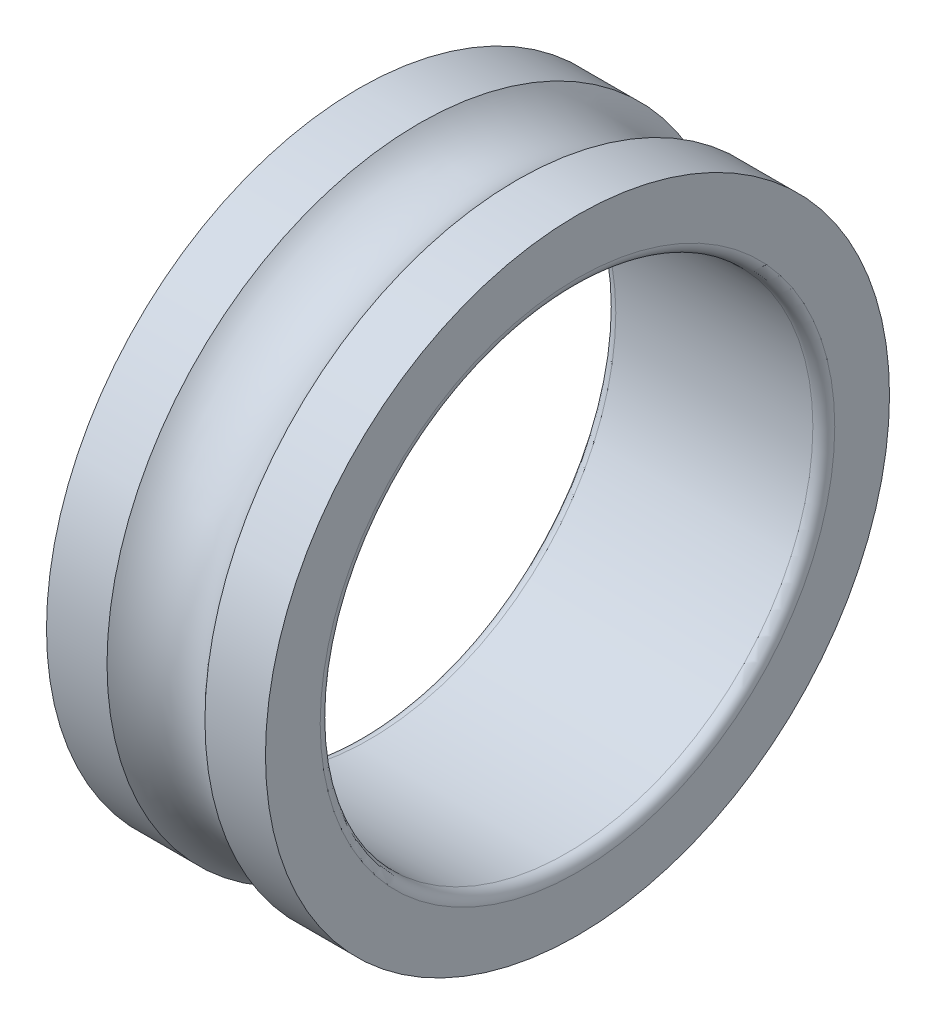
from build123d import *


with BuildPart() as part:
    # Esquisse1 → Base-R_volution (revolve)
    with BuildSketch(Plane(origin=(0, 0, 0), x_dir=(1, 0, 0), z_dir=(0, 1, 0)), mode=Mode.PRIVATE) as base_r_volution_sk:
        with BuildLine():
            Line((0, 5.7), (0, 4.7))
            ThreePointArc((0, 4.7), (0.058578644, 4.558578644), (0.2, 4.5))
            Line((0.2, 4.5), (3.8, 4.5))
            ThreePointArc((3.8, 4.5), (3.941421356, 4.558578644), (4, 4.7))
            Line((4, 4.7), (4, 5.7))
            Line((4, 5.7), (2.894427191, 5.7))
            ThreePointArc((2.894427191, 5.7), (2, 5.3), (1.105572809, 5.7))
            Line((1.105572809, 5.7), (0, 5.7))
        make_face()
    revolve(base_r_volution_sk.sketch.rotate(Axis((0, 0, 0), (1, 0, 0)), 180), axis=Axis((0, 0, 0), (1, 0, 0)))


solid = part.part
